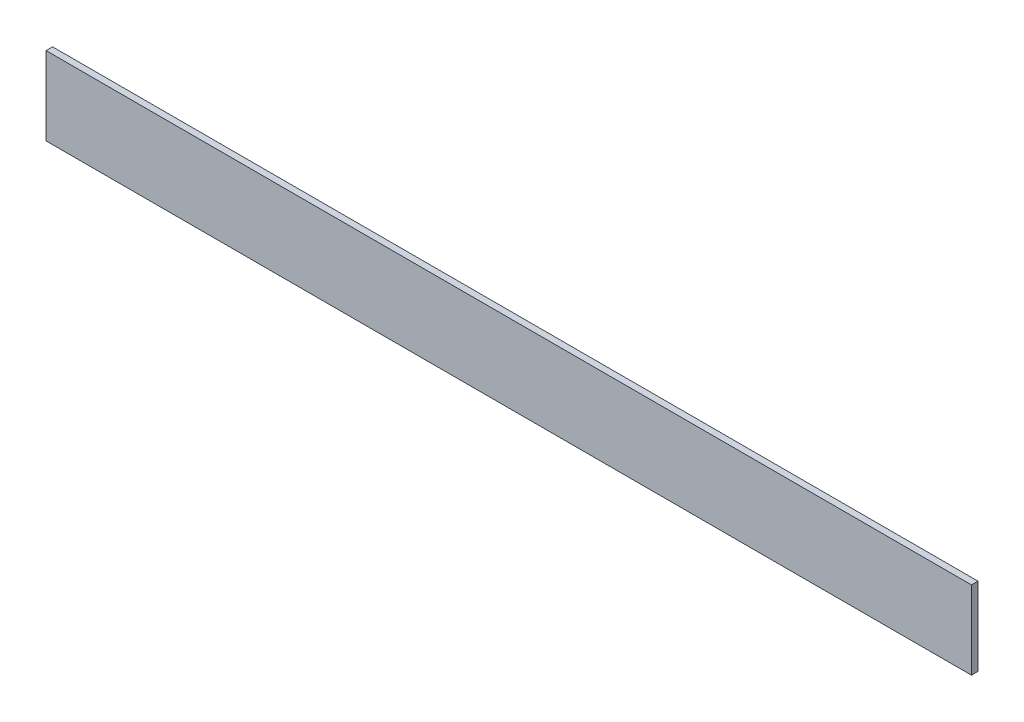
ISO-10303-21;
HEADER;
FILE_DESCRIPTION(('STEP AP214'),'2;1');
FILE_NAME('part.step','',(''),(''),'','','');
FILE_SCHEMA(('AUTOMOTIVE_DESIGN { 1 0 10303 214 1 1 1 1 }'));
ENDSEC;
DATA;
#1=APPLICATION_CONTEXT('core data for automotive mechanical design processes');
#2=APPLICATION_PROTOCOL_DEFINITION('international standard','automotive_design',2000,#1);
#3=PRODUCT_CONTEXT('',#1,'mechanical');
#4=PRODUCT('Part','Part','',(#3));
#5=PRODUCT_RELATED_PRODUCT_CATEGORY('part','',(#4));
#6=PRODUCT_DEFINITION_FORMATION('','',#4);
#7=PRODUCT_DEFINITION_CONTEXT('part definition',#1,'design');
#8=PRODUCT_DEFINITION('design','',#6,#7);
#9=PRODUCT_DEFINITION_SHAPE('','',#8);
#10=(LENGTH_UNIT() NAMED_UNIT(*) SI_UNIT(.MILLI.,.METRE.));
#11=(NAMED_UNIT(*) PLANE_ANGLE_UNIT() SI_UNIT($,.RADIAN.));
#12=(NAMED_UNIT(*) SI_UNIT($,.STERADIAN.) SOLID_ANGLE_UNIT());
#13=UNCERTAINTY_MEASURE_WITH_UNIT(LENGTH_MEASURE(1.E-05),#10,'distance_accuracy_value','');
#14=(GEOMETRIC_REPRESENTATION_CONTEXT(3) GLOBAL_UNCERTAINTY_ASSIGNED_CONTEXT((#13)) GLOBAL_UNIT_ASSIGNED_CONTEXT((#10,
#11,#12)) REPRESENTATION_CONTEXT('',''));
#15=CARTESIAN_POINT('',(0.,0.,0.));
#16=DIRECTION('',(0.,0.,1.));
#17=DIRECTION('',(1.,0.,0.));
#18=AXIS2_PLACEMENT_3D('',#15,#16,#17);
#19=CARTESIAN_POINT('',(450.85,-38.1,6.35));
#20=DIRECTION('',(-1.,0.,0.));
#21=DIRECTION('',(0.,0.,1.));
#22=AXIS2_PLACEMENT_3D('',#19,#20,#21);
#23=PLANE('',#22);
#24=DIRECTION('',(0.,1.,0.));
#25=VECTOR('',#24,1.);
#26=CARTESIAN_POINT('',(450.85,-38.1,0.));
#27=LINE('',#26,#25);
#28=CARTESIAN_POINT('',(450.85,-38.1,0.));
#29=VERTEX_POINT('',#28);
#30=CARTESIAN_POINT('',(450.85,38.1,0.));
#31=VERTEX_POINT('',#30);
#32=EDGE_CURVE('E112',#29,#31,#27,.T.);
#33=ORIENTED_EDGE('',*,*,#32,.T.);
#34=DIRECTION('',(0.,0.,-1.));
#35=VECTOR('',#34,1.);
#36=CARTESIAN_POINT('',(450.85,38.1,6.35));
#37=LINE('',#36,#35);
#38=CARTESIAN_POINT('',(450.85,38.1,6.35));
#39=VERTEX_POINT('',#38);
#40=EDGE_CURVE('E11',#39,#31,#37,.T.);
#41=ORIENTED_EDGE('',*,*,#40,.F.);
#42=DIRECTION('',(0.,1.,0.));
#43=VECTOR('',#42,1.);
#44=CARTESIAN_POINT('',(450.85,-38.1,6.35));
#45=LINE('',#44,#43);
#46=CARTESIAN_POINT('',(450.85,-38.1,6.35));
#47=VERTEX_POINT('',#46);
#48=EDGE_CURVE('E95',#47,#39,#45,.T.);
#49=ORIENTED_EDGE('',*,*,#48,.F.);
#50=DIRECTION('',(0.,0.,-1.));
#51=VECTOR('',#50,1.);
#52=CARTESIAN_POINT('',(450.85,-38.1,6.35));
#53=LINE('',#52,#51);
#54=EDGE_CURVE('E108',#47,#29,#53,.T.);
#55=ORIENTED_EDGE('',*,*,#54,.T.);
#56=EDGE_LOOP('',(#33,#41,#49,#55));
#57=FACE_BOUND('',#56,.T.);
#58=ADVANCED_FACE('F38',(#57),#23,.F.);
#59=CARTESIAN_POINT('',(-450.85,38.1,6.35));
#60=DIRECTION('',(0.,-1.,0.));
#61=DIRECTION('',(0.,0.,-1.));
#62=AXIS2_PLACEMENT_3D('',#59,#60,#61);
#63=PLANE('',#62);
#64=DIRECTION('',(-1.,0.,0.));
#65=VECTOR('',#64,1.);
#66=CARTESIAN_POINT('',(-450.85,38.1,0.));
#67=LINE('',#66,#65);
#68=CARTESIAN_POINT('',(-450.85,38.1,0.));
#69=VERTEX_POINT('',#68);
#70=EDGE_CURVE('E100',#31,#69,#67,.T.);
#71=ORIENTED_EDGE('',*,*,#70,.T.);
#72=DIRECTION('',(0.,0.,-1.));
#73=VECTOR('',#72,1.);
#74=CARTESIAN_POINT('',(-450.85,38.1,6.35));
#75=LINE('',#74,#73);
#76=CARTESIAN_POINT('',(-450.85,38.1,6.35));
#77=VERTEX_POINT('',#76);
#78=EDGE_CURVE('E46',#77,#69,#75,.T.);
#79=ORIENTED_EDGE('',*,*,#78,.F.);
#80=DIRECTION('',(-1.,0.,0.));
#81=VECTOR('',#80,1.);
#82=CARTESIAN_POINT('',(-450.85,38.1,6.35));
#83=LINE('',#82,#81);
#84=EDGE_CURVE('E90',#39,#77,#83,.T.);
#85=ORIENTED_EDGE('',*,*,#84,.F.);
#86=ORIENTED_EDGE('',*,*,#40,.T.);
#87=EDGE_LOOP('',(#71,#79,#85,#86));
#88=FACE_BOUND('',#87,.T.);
#89=ADVANCED_FACE('F99',(#88),#63,.F.);
#90=CARTESIAN_POINT('',(-450.85,-38.1,6.35));
#91=DIRECTION('',(1.,0.,0.));
#92=DIRECTION('',(0.,0.,-1.));
#93=AXIS2_PLACEMENT_3D('',#90,#91,#92);
#94=PLANE('',#93);
#95=DIRECTION('',(0.,-1.,0.));
#96=VECTOR('',#95,1.);
#97=CARTESIAN_POINT('',(-450.85,-38.1,0.));
#98=LINE('',#97,#96);
#99=CARTESIAN_POINT('',(-450.85,-38.1,0.));
#100=VERTEX_POINT('',#99);
#101=EDGE_CURVE('E77',#69,#100,#98,.T.);
#102=ORIENTED_EDGE('',*,*,#101,.T.);
#103=DIRECTION('',(0.,0.,-1.));
#104=VECTOR('',#103,1.);
#105=CARTESIAN_POINT('',(-450.85,-38.1,6.35));
#106=LINE('',#105,#104);
#107=CARTESIAN_POINT('',(-450.85,-38.1,6.35));
#108=VERTEX_POINT('',#107);
#109=EDGE_CURVE('E102',#108,#100,#106,.T.);
#110=ORIENTED_EDGE('',*,*,#109,.F.);
#111=DIRECTION('',(0.,-1.,0.));
#112=VECTOR('',#111,1.);
#113=CARTESIAN_POINT('',(-450.85,-38.1,6.35));
#114=LINE('',#113,#112);
#115=EDGE_CURVE('E93',#77,#108,#114,.T.);
#116=ORIENTED_EDGE('',*,*,#115,.F.);
#117=ORIENTED_EDGE('',*,*,#78,.T.);
#118=EDGE_LOOP('',(#102,#110,#116,#117));
#119=FACE_BOUND('',#118,.T.);
#120=ADVANCED_FACE('F103',(#119),#94,.F.);
#121=CARTESIAN_POINT('',(-450.85,-38.1,6.35));
#122=DIRECTION('',(0.,1.,0.));
#123=DIRECTION('',(0.,0.,1.));
#124=AXIS2_PLACEMENT_3D('',#121,#122,#123);
#125=PLANE('',#124);
#126=DIRECTION('',(1.,0.,0.));
#127=VECTOR('',#126,1.);
#128=CARTESIAN_POINT('',(-450.85,-38.1,0.));
#129=LINE('',#128,#127);
#130=EDGE_CURVE('E83',#100,#29,#129,.T.);
#131=ORIENTED_EDGE('',*,*,#130,.T.);
#132=ORIENTED_EDGE('',*,*,#54,.F.);
#133=DIRECTION('',(1.,0.,0.));
#134=VECTOR('',#133,1.);
#135=CARTESIAN_POINT('',(-450.85,-38.1,6.35));
#136=LINE('',#135,#134);
#137=EDGE_CURVE('E57',#108,#47,#136,.T.);
#138=ORIENTED_EDGE('',*,*,#137,.F.);
#139=ORIENTED_EDGE('',*,*,#109,.T.);
#140=EDGE_LOOP('',(#131,#132,#138,#139));
#141=FACE_BOUND('',#140,.T.);
#142=ADVANCED_FACE('F124',(#141),#125,.F.);
#143=CARTESIAN_POINT('',(0.,0.,6.35));
#144=DIRECTION('',(0.,0.,-1.));
#145=DIRECTION('',(-1.,0.,0.));
#146=AXIS2_PLACEMENT_3D('',#143,#144,#145);
#147=PLANE('',#146);
#148=ORIENTED_EDGE('',*,*,#48,.T.);
#149=ORIENTED_EDGE('',*,*,#84,.T.);
#150=ORIENTED_EDGE('',*,*,#115,.T.);
#151=ORIENTED_EDGE('',*,*,#137,.T.);
#152=EDGE_LOOP('',(#148,#149,#150,#151));
#153=FACE_BOUND('',#152,.T.);
#154=ADVANCED_FACE('F91',(#153),#147,.F.);
#155=CARTESIAN_POINT('',(0.,0.,0.));
#156=DIRECTION('',(0.,0.,-1.));
#157=DIRECTION('',(-1.,0.,0.));
#158=AXIS2_PLACEMENT_3D('',#155,#156,#157);
#159=PLANE('',#158);
#160=ORIENTED_EDGE('',*,*,#32,.F.);
#161=ORIENTED_EDGE('',*,*,#130,.F.);
#162=ORIENTED_EDGE('',*,*,#101,.F.);
#163=ORIENTED_EDGE('',*,*,#70,.F.);
#164=EDGE_LOOP('',(#160,#161,#162,#163));
#165=FACE_BOUND('',#164,.T.);
#166=ADVANCED_FACE('F127',(#165),#159,.T.);
#167=CLOSED_SHELL('',(#58,#89,#120,#142,#154,#166));
#168=MANIFOLD_SOLID_BREP('B2',#167);
#169=ADVANCED_BREP_SHAPE_REPRESENTATION('',(#18,#168),#14);
#170=SHAPE_DEFINITION_REPRESENTATION(#9,#169);
ENDSEC;
END-ISO-10303-21;
